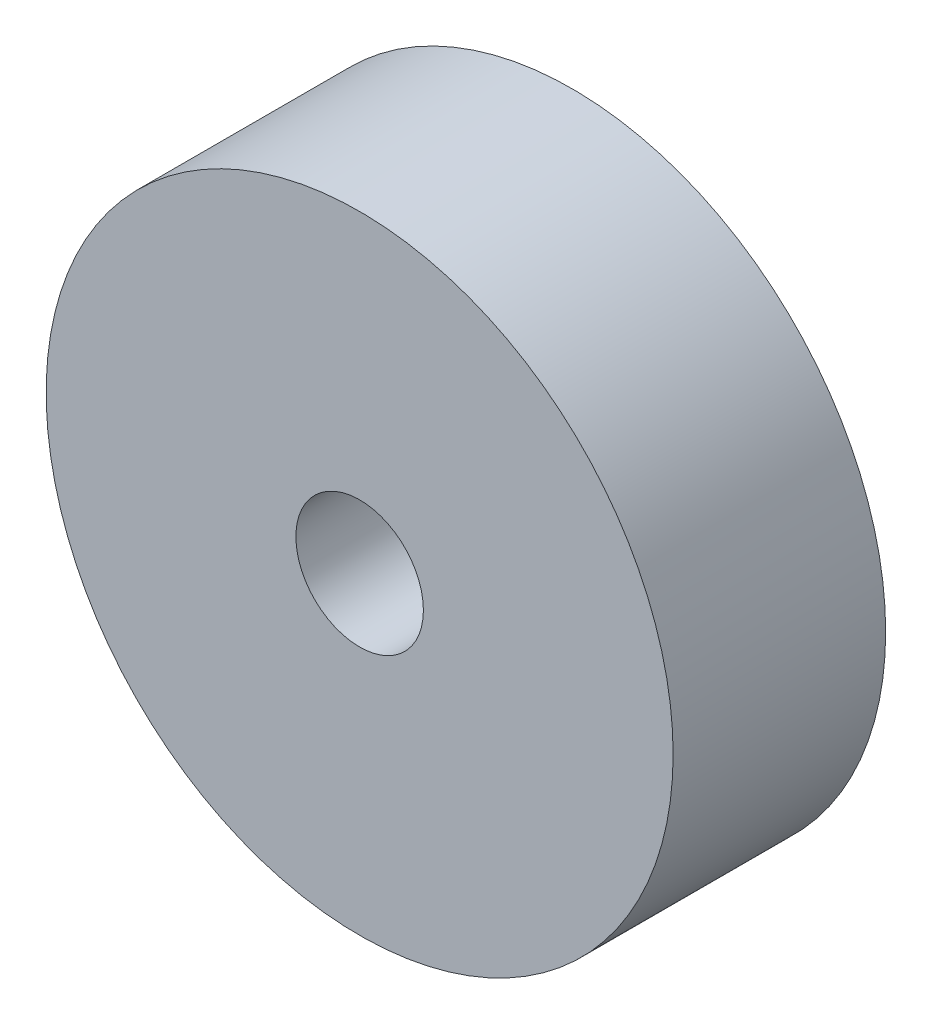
ISO-10303-21;
HEADER;
FILE_DESCRIPTION(('STEP AP214'),'2;1');
FILE_NAME('part.step','',(''),(''),'','','');
FILE_SCHEMA(('AUTOMOTIVE_DESIGN { 1 0 10303 214 1 1 1 1 }'));
ENDSEC;
DATA;
#1=APPLICATION_CONTEXT('core data for automotive mechanical design processes');
#2=APPLICATION_PROTOCOL_DEFINITION('international standard','automotive_design',2000,#1);
#3=PRODUCT_CONTEXT('',#1,'mechanical');
#4=PRODUCT('Part','Part','',(#3));
#5=PRODUCT_RELATED_PRODUCT_CATEGORY('part','',(#4));
#6=PRODUCT_DEFINITION_FORMATION('','',#4);
#7=PRODUCT_DEFINITION_CONTEXT('part definition',#1,'design');
#8=PRODUCT_DEFINITION('design','',#6,#7);
#9=PRODUCT_DEFINITION_SHAPE('','',#8);
#10=(LENGTH_UNIT() NAMED_UNIT(*) SI_UNIT(.MILLI.,.METRE.));
#11=(NAMED_UNIT(*) PLANE_ANGLE_UNIT() SI_UNIT($,.RADIAN.));
#12=(NAMED_UNIT(*) SI_UNIT($,.STERADIAN.) SOLID_ANGLE_UNIT());
#13=UNCERTAINTY_MEASURE_WITH_UNIT(LENGTH_MEASURE(1.E-05),#10,'distance_accuracy_value','');
#14=(GEOMETRIC_REPRESENTATION_CONTEXT(3) GLOBAL_UNCERTAINTY_ASSIGNED_CONTEXT((#13)) GLOBAL_UNIT_ASSIGNED_CONTEXT((#10,
#11,#12)) REPRESENTATION_CONTEXT('',''));
#15=CARTESIAN_POINT('',(0.,0.,0.));
#16=DIRECTION('',(0.,0.,1.));
#17=DIRECTION('',(1.,0.,0.));
#18=AXIS2_PLACEMENT_3D('',#15,#16,#17);
#19=CARTESIAN_POINT('',(0.,0.,10.));
#20=DIRECTION('',(0.,0.,1.));
#21=DIRECTION('',(1.,0.,0.));
#22=AXIS2_PLACEMENT_3D('',#19,#20,#21);
#23=PLANE('',#22);
#24=CARTESIAN_POINT('',(0.,0.,10.));
#25=DIRECTION('',(0.,0.,1.));
#26=DIRECTION('',(1.,0.,0.));
#27=AXIS2_PLACEMENT_3D('',#24,#25,#26);
#28=CIRCLE('',#27,14.75);
#29=CARTESIAN_POINT('',(14.75,0.,10.));
#30=VERTEX_POINT('',#29);
#31=EDGE_CURVE('E10',#30,#30,#28,.T.);
#32=ORIENTED_EDGE('',*,*,#31,.T.);
#33=EDGE_LOOP('',(#32));
#34=FACE_BOUND('',#33,.T.);
#35=CARTESIAN_POINT('',(0.,0.,10.));
#36=DIRECTION('',(0.,0.,1.));
#37=DIRECTION('',(1.,0.,0.));
#38=AXIS2_PLACEMENT_3D('',#35,#36,#37);
#39=CIRCLE('',#38,3.);
#40=CARTESIAN_POINT('',(3.,0.,10.));
#41=VERTEX_POINT('',#40);
#42=EDGE_CURVE('E56',#41,#41,#39,.T.);
#43=ORIENTED_EDGE('',*,*,#42,.F.);
#44=EDGE_LOOP('',(#43));
#45=FACE_BOUND('',#44,.T.);
#46=ADVANCED_FACE('F43',(#34,#45),#23,.T.);
#47=CARTESIAN_POINT('',(0.,0.,0.));
#48=DIRECTION('',(0.,0.,1.));
#49=DIRECTION('',(1.,0.,0.));
#50=AXIS2_PLACEMENT_3D('',#47,#48,#49);
#51=PLANE('',#50);
#52=CARTESIAN_POINT('',(0.,0.,0.));
#53=DIRECTION('',(0.,0.,1.));
#54=DIRECTION('',(1.,0.,0.));
#55=AXIS2_PLACEMENT_3D('',#52,#53,#54);
#56=CIRCLE('',#55,14.75);
#57=CARTESIAN_POINT('',(14.75,0.,0.));
#58=VERTEX_POINT('',#57);
#59=EDGE_CURVE('E47',#58,#58,#56,.T.);
#60=ORIENTED_EDGE('',*,*,#59,.F.);
#61=EDGE_LOOP('',(#60));
#62=FACE_BOUND('',#61,.T.);
#63=CARTESIAN_POINT('',(0.,0.,0.));
#64=DIRECTION('',(0.,0.,1.));
#65=DIRECTION('',(1.,0.,0.));
#66=AXIS2_PLACEMENT_3D('',#63,#64,#65);
#67=CIRCLE('',#66,3.);
#68=CARTESIAN_POINT('',(3.,0.,0.));
#69=VERTEX_POINT('',#68);
#70=EDGE_CURVE('E58',#69,#69,#67,.T.);
#71=ORIENTED_EDGE('',*,*,#70,.T.);
#72=EDGE_LOOP('',(#71));
#73=FACE_BOUND('',#72,.T.);
#74=ADVANCED_FACE('F70',(#62,#73),#51,.F.);
#75=CARTESIAN_POINT('',(0.,0.,10.));
#76=DIRECTION('',(0.,0.,-1.));
#77=DIRECTION('',(-1.,0.,0.));
#78=AXIS2_PLACEMENT_3D('',#75,#76,#77);
#79=CYLINDRICAL_SURFACE('',#78,14.75);
#80=ORIENTED_EDGE('',*,*,#31,.F.);
#81=EDGE_LOOP('',(#80));
#82=FACE_BOUND('',#81,.T.);
#83=ORIENTED_EDGE('',*,*,#59,.T.);
#84=EDGE_LOOP('',(#83));
#85=FACE_BOUND('',#84,.T.);
#86=ADVANCED_FACE('F45',(#82,#85),#79,.T.);
#87=CARTESIAN_POINT('',(0.,0.,10.));
#88=DIRECTION('',(0.,0.,-1.));
#89=DIRECTION('',(-1.,0.,0.));
#90=AXIS2_PLACEMENT_3D('',#87,#88,#89);
#91=CYLINDRICAL_SURFACE('',#90,3.);
#92=ORIENTED_EDGE('',*,*,#42,.T.);
#93=EDGE_LOOP('',(#92));
#94=FACE_BOUND('',#93,.T.);
#95=ORIENTED_EDGE('',*,*,#70,.F.);
#96=EDGE_LOOP('',(#95));
#97=FACE_BOUND('',#96,.T.);
#98=ADVANCED_FACE('F66',(#94,#97),#91,.F.);
#99=CLOSED_SHELL('',(#46,#74,#86,#98));
#100=MANIFOLD_SOLID_BREP('B2',#99);
#101=ADVANCED_BREP_SHAPE_REPRESENTATION('',(#18,#100),#14);
#102=SHAPE_DEFINITION_REPRESENTATION(#9,#101);
ENDSEC;
END-ISO-10303-21;
